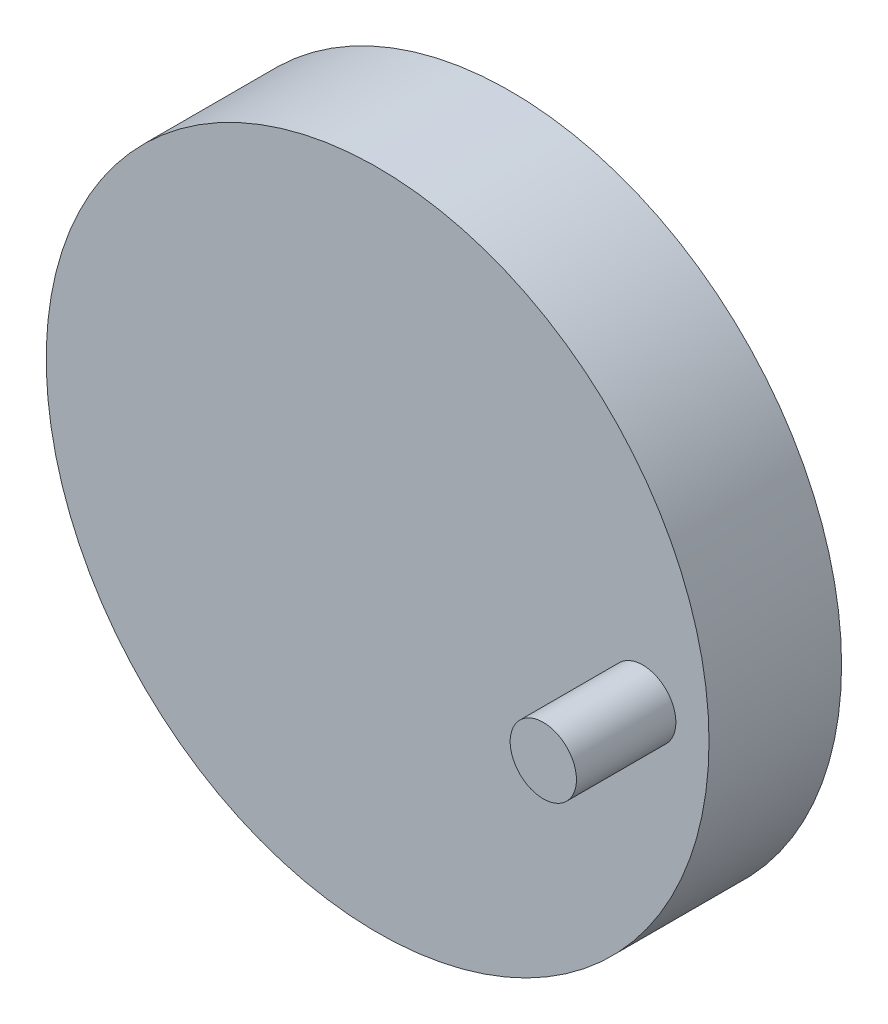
ISO-10303-21;
HEADER;
FILE_DESCRIPTION(('STEP AP214'),'2;1');
FILE_NAME('part.step','',(''),(''),'','','');
FILE_SCHEMA(('AUTOMOTIVE_DESIGN { 1 0 10303 214 1 1 1 1 }'));
ENDSEC;
DATA;
#1=APPLICATION_CONTEXT('core data for automotive mechanical design processes');
#2=APPLICATION_PROTOCOL_DEFINITION('international standard','automotive_design',2000,#1);
#3=PRODUCT_CONTEXT('',#1,'mechanical');
#4=PRODUCT('Part','Part','',(#3));
#5=PRODUCT_RELATED_PRODUCT_CATEGORY('part','',(#4));
#6=PRODUCT_DEFINITION_FORMATION('','',#4);
#7=PRODUCT_DEFINITION_CONTEXT('part definition',#1,'design');
#8=PRODUCT_DEFINITION('design','',#6,#7);
#9=PRODUCT_DEFINITION_SHAPE('','',#8);
#10=(LENGTH_UNIT() NAMED_UNIT(*) SI_UNIT(.MILLI.,.METRE.));
#11=(NAMED_UNIT(*) PLANE_ANGLE_UNIT() SI_UNIT($,.RADIAN.));
#12=(NAMED_UNIT(*) SI_UNIT($,.STERADIAN.) SOLID_ANGLE_UNIT());
#13=UNCERTAINTY_MEASURE_WITH_UNIT(LENGTH_MEASURE(1.E-05),#10,'distance_accuracy_value','');
#14=(GEOMETRIC_REPRESENTATION_CONTEXT(3) GLOBAL_UNCERTAINTY_ASSIGNED_CONTEXT((#13)) GLOBAL_UNIT_ASSIGNED_CONTEXT((#10,
#11,#12)) REPRESENTATION_CONTEXT('',''));
#15=CARTESIAN_POINT('',(0.,0.,0.));
#16=DIRECTION('',(0.,0.,1.));
#17=DIRECTION('',(1.,0.,0.));
#18=AXIS2_PLACEMENT_3D('',#15,#16,#17);
#19=CARTESIAN_POINT('',(0.,0.,20.));
#20=DIRECTION('',(0.,0.,-1.));
#21=DIRECTION('',(-1.,0.,0.));
#22=AXIS2_PLACEMENT_3D('',#19,#20,#21);
#23=CYLINDRICAL_SURFACE('',#22,50.);
#24=CARTESIAN_POINT('',(0.,0.,20.));
#25=DIRECTION('',(0.,0.,1.));
#26=DIRECTION('',(1.,0.,0.));
#27=AXIS2_PLACEMENT_3D('',#24,#25,#26);
#28=CIRCLE('',#27,50.);
#29=CARTESIAN_POINT('',(50.,0.,20.));
#30=VERTEX_POINT('',#29);
#31=EDGE_CURVE('E10',#30,#30,#28,.T.);
#32=ORIENTED_EDGE('',*,*,#31,.F.);
#33=EDGE_LOOP('',(#32));
#34=FACE_BOUND('',#33,.T.);
#35=CARTESIAN_POINT('',(0.,0.,0.));
#36=DIRECTION('',(0.,0.,1.));
#37=DIRECTION('',(1.,0.,0.));
#38=AXIS2_PLACEMENT_3D('',#35,#36,#37);
#39=CIRCLE('',#38,50.);
#40=CARTESIAN_POINT('',(50.,0.,0.));
#41=VERTEX_POINT('',#40);
#42=EDGE_CURVE('E45',#41,#41,#39,.T.);
#43=ORIENTED_EDGE('',*,*,#42,.T.);
#44=EDGE_LOOP('',(#43));
#45=FACE_BOUND('',#44,.T.);
#46=ADVANCED_FACE('F42',(#34,#45),#23,.T.);
#47=CARTESIAN_POINT('',(0.,0.,20.));
#48=DIRECTION('',(0.,0.,1.));
#49=DIRECTION('',(1.,0.,0.));
#50=AXIS2_PLACEMENT_3D('',#47,#48,#49);
#51=PLANE('',#50);
#52=CARTESIAN_POINT('',(40.,0.,20.));
#53=DIRECTION('',(0.,0.,1.));
#54=DIRECTION('',(1.,0.,0.));
#55=AXIS2_PLACEMENT_3D('',#52,#53,#54);
#56=CIRCLE('',#55,5.);
#57=CARTESIAN_POINT('',(45.,0.,20.));
#58=VERTEX_POINT('',#57);
#59=EDGE_CURVE('E57',#58,#58,#56,.F.);
#60=ORIENTED_EDGE('',*,*,#59,.T.);
#61=EDGE_LOOP('',(#60));
#62=FACE_BOUND('',#61,.T.);
#63=ORIENTED_EDGE('',*,*,#31,.T.);
#64=EDGE_LOOP('',(#63));
#65=FACE_BOUND('',#64,.T.);
#66=ADVANCED_FACE('F84',(#62,#65),#51,.T.);
#67=CARTESIAN_POINT('',(0.,0.,0.));
#68=DIRECTION('',(0.,0.,1.));
#69=DIRECTION('',(1.,0.,0.));
#70=AXIS2_PLACEMENT_3D('',#67,#68,#69);
#71=PLANE('',#70);
#72=CARTESIAN_POINT('',(0.,0.,0.));
#73=DIRECTION('',(0.,0.,1.));
#74=DIRECTION('',(1.,0.,0.));
#75=AXIS2_PLACEMENT_3D('',#72,#73,#74);
#76=CIRCLE('',#75,10.);
#77=CARTESIAN_POINT('',(10.,0.,0.));
#78=VERTEX_POINT('',#77);
#79=EDGE_CURVE('E54',#78,#78,#76,.T.);
#80=ORIENTED_EDGE('',*,*,#79,.T.);
#81=EDGE_LOOP('',(#80));
#82=FACE_BOUND('',#81,.T.);
#83=ORIENTED_EDGE('',*,*,#42,.F.);
#84=EDGE_LOOP('',(#83));
#85=FACE_BOUND('',#84,.T.);
#86=ADVANCED_FACE('F90',(#82,#85),#71,.F.);
#87=CARTESIAN_POINT('',(0.,0.,-20.));
#88=DIRECTION('',(0.,0.,1.));
#89=DIRECTION('',(1.,0.,0.));
#90=AXIS2_PLACEMENT_3D('',#87,#88,#89);
#91=CYLINDRICAL_SURFACE('',#90,10.);
#92=CARTESIAN_POINT('',(0.,0.,-20.));
#93=DIRECTION('',(0.,0.,1.));
#94=DIRECTION('',(1.,0.,0.));
#95=AXIS2_PLACEMENT_3D('',#92,#93,#94);
#96=CIRCLE('',#95,10.);
#97=CARTESIAN_POINT('',(10.,0.,-20.));
#98=VERTEX_POINT('',#97);
#99=EDGE_CURVE('E52',#98,#98,#96,.T.);
#100=ORIENTED_EDGE('',*,*,#99,.T.);
#101=EDGE_LOOP('',(#100));
#102=FACE_BOUND('',#101,.T.);
#103=ORIENTED_EDGE('',*,*,#79,.F.);
#104=EDGE_LOOP('',(#103));
#105=FACE_BOUND('',#104,.T.);
#106=ADVANCED_FACE('F79',(#102,#105),#91,.T.);
#107=CARTESIAN_POINT('',(0.,0.,-20.));
#108=DIRECTION('',(0.,0.,1.));
#109=DIRECTION('',(1.,0.,0.));
#110=AXIS2_PLACEMENT_3D('',#107,#108,#109);
#111=PLANE('',#110);
#112=ORIENTED_EDGE('',*,*,#99,.F.);
#113=EDGE_LOOP('',(#112));
#114=FACE_BOUND('',#113,.T.);
#115=ADVANCED_FACE('F70',(#114),#111,.F.);
#116=CARTESIAN_POINT('',(40.,0.,35.));
#117=DIRECTION('',(0.,0.,-1.));
#118=DIRECTION('',(-1.,0.,0.));
#119=AXIS2_PLACEMENT_3D('',#116,#117,#118);
#120=CYLINDRICAL_SURFACE('',#119,5.);
#121=ORIENTED_EDGE('',*,*,#59,.F.);
#122=EDGE_LOOP('',(#121));
#123=FACE_BOUND('',#122,.T.);
#124=CARTESIAN_POINT('',(40.,0.,35.));
#125=DIRECTION('',(0.,0.,1.));
#126=DIRECTION('',(1.,0.,0.));
#127=AXIS2_PLACEMENT_3D('',#124,#125,#126);
#128=CIRCLE('',#127,5.);
#129=CARTESIAN_POINT('',(45.,0.,35.));
#130=VERTEX_POINT('',#129);
#131=EDGE_CURVE('E62',#130,#130,#128,.T.);
#132=ORIENTED_EDGE('',*,*,#131,.F.);
#133=EDGE_LOOP('',(#132));
#134=FACE_BOUND('',#133,.T.);
#135=ADVANCED_FACE('F68',(#123,#134),#120,.T.);
#136=CARTESIAN_POINT('',(40.,0.,35.));
#137=DIRECTION('',(0.,0.,1.));
#138=DIRECTION('',(1.,0.,0.));
#139=AXIS2_PLACEMENT_3D('',#136,#137,#138);
#140=PLANE('',#139);
#141=ORIENTED_EDGE('',*,*,#131,.T.);
#142=EDGE_LOOP('',(#141));
#143=FACE_BOUND('',#142,.T.);
#144=ADVANCED_FACE('F66',(#143),#140,.T.);
#145=CLOSED_SHELL('',(#46,#66,#86,#106,#115,#135,#144));
#146=MANIFOLD_SOLID_BREP('B2',#145);
#147=ADVANCED_BREP_SHAPE_REPRESENTATION('',(#18,#146),#14);
#148=SHAPE_DEFINITION_REPRESENTATION(#9,#147);
ENDSEC;
END-ISO-10303-21;
